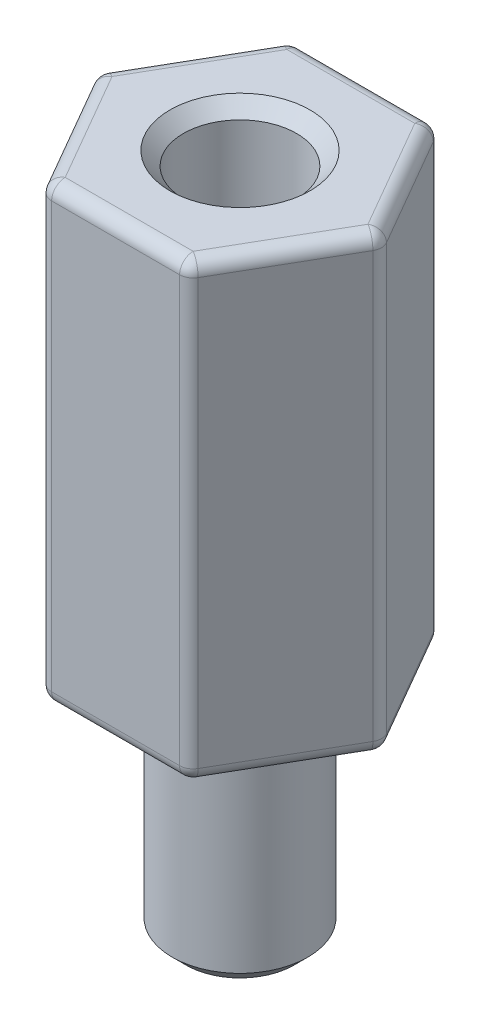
from build123d import *

# Parameters (mm, degrees)
SKETCH1_R           = 1.25
BOSS_EXTRUDE1_DEPTH = 10
FILLET1_R           = 0.3
FILLET2_R           = 0.3
SKETCH2_R           = 1.5
BOSS_EXTRUDE2_DEPTH = 5
CHAMFER1_SIZE       = 0.3
FILLET3_R           = 0.3


with BuildPart() as part:
    # Sketch1 → Boss-Extrude1 (new body)
    with BuildSketch(Plane(origin=(0, 0, 0), x_dir=(1, 0, 0), z_dir=(0, 1, 0))):
        Polygon((-1.58771324, 2.75), (-3.175426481, 0), (-1.58771324, -2.75), (1.58771324, -2.75), (3.175426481, 0), (1.58771324, 2.75), align=None)
        with Locations(Location((0, 0, 0), (0, 0, 270))):
            Circle(SKETCH1_R, mode=Mode.SUBTRACT)
    extrude(amount=BOSS_EXTRUDE1_DEPTH)

    # Fillet1
    fillet1_edges = [part.edges().sort_by_distance(p)[0] for p in [
        (1.58771324, 5, -2.75),
        (3.175426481, 5, 0),
        (1.58771324, 5, 2.75),
        (-1.58771324, 5, 2.75),
        (-3.175426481, 5, 0),
        (-1.58771324, 5, -2.75),
    ]]
    fillet(fillet1_edges, radius=FILLET1_R)

    # Fillet2
    fillet2_edges = [part.edges().sort_by_distance(p)[0] for p in [
        (0, 0, -2.75),
        (0, 10, -2.75),
        (2.38156986, 0, -1.375),
        (2.38156986, 0, 1.375),
        (0, 0, 2.75),
        (-2.38156986, 0, 1.375),
        (-2.38156986, 0, -1.375),
        (1.56450816, 0, 2.709807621),
        (-1.56450816, 0, 2.709807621),
        (-3.129016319, 0, 0),
        (-1.56450816, 0, -2.709807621),
        (3.129016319, 0, 0),
        (1.56450816, 0, -2.709807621),
        (2.38156986, 10, -1.375),
        (-2.38156986, 10, -1.375),
        (-2.38156986, 10, 1.375),
        (0, 10, 2.75),
        (2.38156986, 10, 1.375),
        (1.56450816, 10, 2.709807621),
        (-1.56450816, 10, 2.709807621),
        (-3.129016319, 10, 0),
        (-1.56450816, 10, -2.709807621),
        (3.129016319, 10, 0),
        (1.56450816, 10, -2.709807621),
    ]]
    fillet(fillet2_edges, radius=FILLET2_R)

    # Sketch2 → Boss-Extrude2 (add)
    with BuildSketch(Plane.XZ):
        with Locations(Location((0, 0, 0), (0, 0, 90))):
            Circle(SKETCH2_R)
    extrude(amount=BOSS_EXTRUDE2_DEPTH)

    # Chamfer1
    chamfer1_edges = [part.edges().sort_by_distance(p)[0] for p in [
        (0, -5, -1.5),
        (0, 10, -1.25),
    ]]
    chamfer(chamfer1_edges, length=CHAMFER1_SIZE)

    # Fillet3
    fillet3_edges = [part.edges().sort_by_distance(p)[0] for p in [
        (0, 0, -1.5),
    ]]
    fillet(fillet3_edges, radius=FILLET3_R)


solid = part.part
